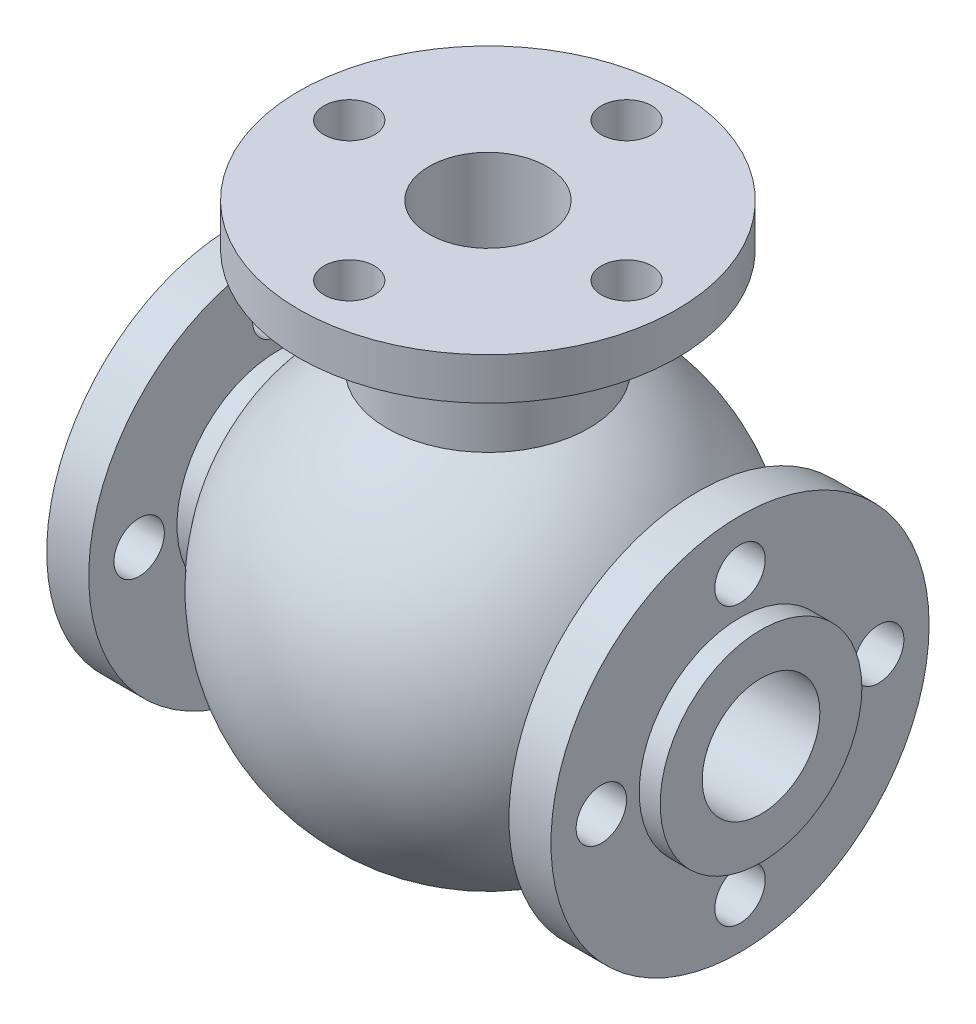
ISO-10303-21;
HEADER;
FILE_DESCRIPTION(('STEP AP214'),'2;1');
FILE_NAME('part.step','',(''),(''),'','','');
FILE_SCHEMA(('AUTOMOTIVE_DESIGN { 1 0 10303 214 1 1 1 1 }'));
ENDSEC;
DATA;
#1=APPLICATION_CONTEXT('core data for automotive mechanical design processes');
#2=APPLICATION_PROTOCOL_DEFINITION('international standard','automotive_design',2000,#1);
#3=PRODUCT_CONTEXT('',#1,'mechanical');
#4=PRODUCT('Part','Part','',(#3));
#5=PRODUCT_RELATED_PRODUCT_CATEGORY('part','',(#4));
#6=PRODUCT_DEFINITION_FORMATION('','',#4);
#7=PRODUCT_DEFINITION_CONTEXT('part definition',#1,'design');
#8=PRODUCT_DEFINITION('design','',#6,#7);
#9=PRODUCT_DEFINITION_SHAPE('','',#8);
#10=(LENGTH_UNIT() NAMED_UNIT(*) SI_UNIT(.MILLI.,.METRE.));
#11=(NAMED_UNIT(*) PLANE_ANGLE_UNIT() SI_UNIT($,.RADIAN.));
#12=(NAMED_UNIT(*) SI_UNIT($,.STERADIAN.) SOLID_ANGLE_UNIT());
#13=UNCERTAINTY_MEASURE_WITH_UNIT(LENGTH_MEASURE(1.E-05),#10,'distance_accuracy_value','');
#14=(GEOMETRIC_REPRESENTATION_CONTEXT(3) GLOBAL_UNCERTAINTY_ASSIGNED_CONTEXT((#13)) GLOBAL_UNIT_ASSIGNED_CONTEXT((#10,
#11,#12)) REPRESENTATION_CONTEXT('',''));
#15=CARTESIAN_POINT('',(0.,0.,0.));
#16=DIRECTION('',(0.,0.,1.));
#17=DIRECTION('',(1.,0.,0.));
#18=AXIS2_PLACEMENT_3D('',#15,#16,#17);
#19=CARTESIAN_POINT('',(0.,0.,0.));
#20=DIRECTION('',(1.,0.,0.));
#21=DIRECTION('',(0.,1.,0.));
#22=AXIS2_PLACEMENT_3D('',#19,#20,#21);
#23=SPHERICAL_SURFACE('',#22,41.);
#24=CARTESIAN_POINT('',(0.,38.5356977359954,0.));
#25=DIRECTION('',(0.,-1.,0.));
#26=DIRECTION('',(0.,0.,-1.));
#27=AXIS2_PLACEMENT_3D('',#24,#25,#26);
#28=CIRCLE('',#27,14.);
#29=CARTESIAN_POINT('',(0.,38.5356977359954,14.));
#30=VERTEX_POINT('',#29);
#31=EDGE_CURVE('E131',#30,#30,#28,.F.);
#32=ORIENTED_EDGE('',*,*,#31,.T.);
#33=EDGE_LOOP('',(#32));
#34=FACE_BOUND('',#33,.T.);
#35=CARTESIAN_POINT('',(38.5356977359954,0.,0.));
#36=DIRECTION('',(1.,0.,0.));
#37=DIRECTION('',(0.,0.,-1.));
#38=AXIS2_PLACEMENT_3D('',#35,#36,#37);
#39=CIRCLE('',#38,14.);
#40=CARTESIAN_POINT('',(38.5356977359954,0.,-14.));
#41=VERTEX_POINT('',#40);
#42=EDGE_CURVE('E111',#41,#41,#39,.T.);
#43=ORIENTED_EDGE('',*,*,#42,.T.);
#44=EDGE_LOOP('',(#43));
#45=FACE_BOUND('',#44,.T.);
#46=CARTESIAN_POINT('',(-38.5356977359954,0.,0.));
#47=DIRECTION('',(1.,0.,0.));
#48=DIRECTION('',(0.,0.,-1.));
#49=AXIS2_PLACEMENT_3D('',#46,#47,#48);
#50=CIRCLE('',#49,14.);
#51=CARTESIAN_POINT('',(-38.5356977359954,0.,-14.));
#52=VERTEX_POINT('',#51);
#53=EDGE_CURVE('E47',#52,#52,#50,.T.);
#54=ORIENTED_EDGE('',*,*,#53,.F.);
#55=EDGE_LOOP('',(#54));
#56=FACE_BOUND('',#55,.T.);
#57=ADVANCED_FACE('F40',(#34,#45,#56),#23,.F.);
#58=CARTESIAN_POINT('',(53.9110005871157,0.,0.));
#59=DIRECTION('',(1.,0.,0.));
#60=DIRECTION('',(0.,0.,-1.));
#61=AXIS2_PLACEMENT_3D('',#58,#59,#60);
#62=CYLINDRICAL_SURFACE('',#61,14.);
#63=ORIENTED_EDGE('',*,*,#53,.T.);
#64=EDGE_LOOP('',(#63));
#65=FACE_BOUND('',#64,.T.);
#66=CARTESIAN_POINT('',(-65.,0.,0.));
#67=DIRECTION('',(1.,0.,0.));
#68=DIRECTION('',(0.,0.,-1.));
#69=AXIS2_PLACEMENT_3D('',#66,#67,#68);
#70=CIRCLE('',#69,14.);
#71=CARTESIAN_POINT('',(-65.,0.,-14.));
#72=VERTEX_POINT('',#71);
#73=EDGE_CURVE('E52',#72,#72,#70,.T.);
#74=ORIENTED_EDGE('',*,*,#73,.F.);
#75=EDGE_LOOP('',(#74));
#76=FACE_BOUND('',#75,.T.);
#77=ADVANCED_FACE('F265',(#65,#76),#62,.F.);
#78=CARTESIAN_POINT('',(-65.,14.,0.));
#79=DIRECTION('',(-1.,0.,0.));
#80=DIRECTION('',(0.,0.,1.));
#81=AXIS2_PLACEMENT_3D('',#78,#79,#80);
#82=PLANE('',#81);
#83=ORIENTED_EDGE('',*,*,#73,.T.);
#84=EDGE_LOOP('',(#83));
#85=FACE_BOUND('',#84,.T.);
#86=CARTESIAN_POINT('',(-65.,0.,0.));
#87=DIRECTION('',(1.,0.,0.));
#88=DIRECTION('',(0.,0.,-1.));
#89=AXIS2_PLACEMENT_3D('',#86,#87,#88);
#90=CIRCLE('',#89,24.);
#91=CARTESIAN_POINT('',(-65.,0.,-24.));
#92=VERTEX_POINT('',#91);
#93=EDGE_CURVE('E57',#92,#92,#90,.T.);
#94=ORIENTED_EDGE('',*,*,#93,.F.);
#95=EDGE_LOOP('',(#94));
#96=FACE_BOUND('',#95,.T.);
#97=ADVANCED_FACE('F270',(#85,#96),#82,.T.);
#98=CARTESIAN_POINT('',(53.9110005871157,0.,0.));
#99=DIRECTION('',(1.,0.,0.));
#100=DIRECTION('',(0.,0.,-1.));
#101=AXIS2_PLACEMENT_3D('',#98,#99,#100);
#102=CYLINDRICAL_SURFACE('',#101,24.);
#103=ORIENTED_EDGE('',*,*,#93,.T.);
#104=EDGE_LOOP('',(#103));
#105=FACE_BOUND('',#104,.T.);
#106=CARTESIAN_POINT('',(-60.,0.,0.));
#107=DIRECTION('',(1.,0.,0.));
#108=DIRECTION('',(0.,0.,-1.));
#109=AXIS2_PLACEMENT_3D('',#106,#107,#108);
#110=CIRCLE('',#109,24.);
#111=CARTESIAN_POINT('',(-60.,0.,-24.));
#112=VERTEX_POINT('',#111);
#113=EDGE_CURVE('E63',#112,#112,#110,.T.);
#114=ORIENTED_EDGE('',*,*,#113,.F.);
#115=EDGE_LOOP('',(#114));
#116=FACE_BOUND('',#115,.T.);
#117=ADVANCED_FACE('F325',(#105,#116),#102,.T.);
#118=CARTESIAN_POINT('',(-60.,24.,0.));
#119=DIRECTION('',(-1.,0.,0.));
#120=DIRECTION('',(0.,0.,1.));
#121=AXIS2_PLACEMENT_3D('',#118,#119,#120);
#122=PLANE('',#121);
#123=CARTESIAN_POINT('',(-60.,33.,0.));
#124=DIRECTION('',(1.,0.,0.));
#125=DIRECTION('',(0.,0.,-1.));
#126=AXIS2_PLACEMENT_3D('',#123,#124,#125);
#127=CIRCLE('',#126,6.);
#128=CARTESIAN_POINT('',(-60.,33.,-6.));
#129=VERTEX_POINT('',#128);
#130=EDGE_CURVE('E149',#129,#129,#127,.T.);
#131=ORIENTED_EDGE('',*,*,#130,.T.);
#132=EDGE_LOOP('',(#131));
#133=FACE_BOUND('',#132,.T.);
#134=CARTESIAN_POINT('',(-60.,-1.15218884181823E-13,33.));
#135=DIRECTION('',(1.,0.,0.));
#136=DIRECTION('',(0.,1.,0.));
#137=AXIS2_PLACEMENT_3D('',#134,#135,#136);
#138=CIRCLE('',#137,6.);
#139=CARTESIAN_POINT('',(-60.,5.99999999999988,33.));
#140=VERTEX_POINT('',#139);
#141=EDGE_CURVE('E182',#140,#140,#138,.T.);
#142=ORIENTED_EDGE('',*,*,#141,.T.);
#143=EDGE_LOOP('',(#142));
#144=FACE_BOUND('',#143,.T.);
#145=CARTESIAN_POINT('',(-60.,-33.,0.));
#146=DIRECTION('',(1.,0.,0.));
#147=DIRECTION('',(0.,0.,1.));
#148=AXIS2_PLACEMENT_3D('',#145,#146,#147);
#149=CIRCLE('',#148,6.);
#150=CARTESIAN_POINT('',(-60.,-33.,6.));
#151=VERTEX_POINT('',#150);
#152=EDGE_CURVE('E172',#151,#151,#149,.T.);
#153=ORIENTED_EDGE('',*,*,#152,.T.);
#154=EDGE_LOOP('',(#153));
#155=FACE_BOUND('',#154,.T.);
#156=CARTESIAN_POINT('',(-60.,3.4565665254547E-13,-33.));
#157=DIRECTION('',(1.,0.,0.));
#158=DIRECTION('',(0.,-1.,0.));
#159=AXIS2_PLACEMENT_3D('',#156,#157,#158);
#160=CIRCLE('',#159,6.);
#161=CARTESIAN_POINT('',(-60.,-5.99999999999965,-33.0000000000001));
#162=VERTEX_POINT('',#161);
#163=EDGE_CURVE('E173',#162,#162,#160,.T.);
#164=ORIENTED_EDGE('',*,*,#163,.T.);
#165=EDGE_LOOP('',(#164));
#166=FACE_BOUND('',#165,.T.);
#167=ORIENTED_EDGE('',*,*,#113,.T.);
#168=EDGE_LOOP('',(#167));
#169=FACE_BOUND('',#168,.T.);
#170=CARTESIAN_POINT('',(-60.,0.,0.));
#171=DIRECTION('',(1.,0.,0.));
#172=DIRECTION('',(0.,0.,-1.));
#173=AXIS2_PLACEMENT_3D('',#170,#171,#172);
#174=CIRCLE('',#173,45.);
#175=CARTESIAN_POINT('',(-60.,0.,-45.));
#176=VERTEX_POINT('',#175);
#177=EDGE_CURVE('E67',#176,#176,#174,.T.);
#178=ORIENTED_EDGE('',*,*,#177,.F.);
#179=EDGE_LOOP('',(#178));
#180=FACE_BOUND('',#179,.T.);
#181=ADVANCED_FACE('F321',(#133,#144,#155,#166,#169,#180),#122,.T.);
#182=CARTESIAN_POINT('',(53.9110005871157,0.,0.));
#183=DIRECTION('',(1.,0.,0.));
#184=DIRECTION('',(0.,0.,-1.));
#185=AXIS2_PLACEMENT_3D('',#182,#183,#184);
#186=CYLINDRICAL_SURFACE('',#185,45.);
#187=ORIENTED_EDGE('',*,*,#177,.T.);
#188=EDGE_LOOP('',(#187));
#189=FACE_BOUND('',#188,.T.);
#190=CARTESIAN_POINT('',(-50.,0.,0.));
#191=DIRECTION('',(1.,0.,0.));
#192=DIRECTION('',(0.,0.,-1.));
#193=AXIS2_PLACEMENT_3D('',#190,#191,#192);
#194=CIRCLE('',#193,45.);
#195=CARTESIAN_POINT('',(-50.,0.,-45.));
#196=VERTEX_POINT('',#195);
#197=EDGE_CURVE('E71',#196,#196,#194,.T.);
#198=ORIENTED_EDGE('',*,*,#197,.F.);
#199=EDGE_LOOP('',(#198));
#200=FACE_BOUND('',#199,.T.);
#201=ADVANCED_FACE('F317',(#189,#200),#186,.T.);
#202=CARTESIAN_POINT('',(-50.,45.,0.));
#203=DIRECTION('',(1.,0.,0.));
#204=DIRECTION('',(0.,0.,-1.));
#205=AXIS2_PLACEMENT_3D('',#202,#203,#204);
#206=PLANE('',#205);
#207=CARTESIAN_POINT('',(-50.,33.,0.));
#208=DIRECTION('',(1.,0.,0.));
#209=DIRECTION('',(0.,0.,-1.));
#210=AXIS2_PLACEMENT_3D('',#207,#208,#209);
#211=CIRCLE('',#210,6.);
#212=CARTESIAN_POINT('',(-50.,33.,-6.));
#213=VERTEX_POINT('',#212);
#214=EDGE_CURVE('E190',#213,#213,#211,.T.);
#215=ORIENTED_EDGE('',*,*,#214,.F.);
#216=EDGE_LOOP('',(#215));
#217=FACE_BOUND('',#216,.T.);
#218=CARTESIAN_POINT('',(-50.,-1.15218884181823E-13,33.));
#219=DIRECTION('',(1.,0.,0.));
#220=DIRECTION('',(0.,0.,-1.));
#221=AXIS2_PLACEMENT_3D('',#218,#219,#220);
#222=CIRCLE('',#221,6.);
#223=CARTESIAN_POINT('',(-50.,-1.15218884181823E-13,27.));
#224=VERTEX_POINT('',#223);
#225=EDGE_CURVE('E186',#224,#224,#222,.T.);
#226=ORIENTED_EDGE('',*,*,#225,.F.);
#227=EDGE_LOOP('',(#226));
#228=FACE_BOUND('',#227,.T.);
#229=CARTESIAN_POINT('',(-50.,-33.,0.));
#230=DIRECTION('',(1.,0.,0.));
#231=DIRECTION('',(0.,0.,-1.));
#232=AXIS2_PLACEMENT_3D('',#229,#230,#231);
#233=CIRCLE('',#232,6.);
#234=CARTESIAN_POINT('',(-50.,-33.,-6.));
#235=VERTEX_POINT('',#234);
#236=EDGE_CURVE('E178',#235,#235,#233,.T.);
#237=ORIENTED_EDGE('',*,*,#236,.F.);
#238=EDGE_LOOP('',(#237));
#239=FACE_BOUND('',#238,.T.);
#240=CARTESIAN_POINT('',(-50.,3.4565665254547E-13,-33.));
#241=DIRECTION('',(1.,0.,0.));
#242=DIRECTION('',(0.,0.,-1.));
#243=AXIS2_PLACEMENT_3D('',#240,#241,#242);
#244=CIRCLE('',#243,6.);
#245=CARTESIAN_POINT('',(-50.,3.4565665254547E-13,-39.));
#246=VERTEX_POINT('',#245);
#247=EDGE_CURVE('E168',#246,#246,#244,.T.);
#248=ORIENTED_EDGE('',*,*,#247,.F.);
#249=EDGE_LOOP('',(#248));
#250=FACE_BOUND('',#249,.T.);
#251=ORIENTED_EDGE('',*,*,#197,.T.);
#252=EDGE_LOOP('',(#251));
#253=FACE_BOUND('',#252,.T.);
#254=CARTESIAN_POINT('',(-50.,0.,0.));
#255=DIRECTION('',(1.,0.,0.));
#256=DIRECTION('',(0.,0.,-1.));
#257=AXIS2_PLACEMENT_3D('',#254,#255,#256);
#258=CIRCLE('',#257,24.);
#259=CARTESIAN_POINT('',(-50.,0.,-24.));
#260=VERTEX_POINT('',#259);
#261=EDGE_CURVE('E75',#260,#260,#258,.T.);
#262=ORIENTED_EDGE('',*,*,#261,.F.);
#263=EDGE_LOOP('',(#262));
#264=FACE_BOUND('',#263,.T.);
#265=ADVANCED_FACE('F313',(#217,#228,#239,#250,#253,#264),#206,.T.);
#266=CARTESIAN_POINT('',(53.9110005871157,0.,0.));
#267=DIRECTION('',(1.,0.,0.));
#268=DIRECTION('',(0.,0.,-1.));
#269=AXIS2_PLACEMENT_3D('',#266,#267,#268);
#270=CYLINDRICAL_SURFACE('',#269,24.);
#271=ORIENTED_EDGE('',*,*,#261,.T.);
#272=EDGE_LOOP('',(#271));
#273=FACE_BOUND('',#272,.T.);
#274=CARTESIAN_POINT('',(-45.,0.,0.));
#275=DIRECTION('',(1.,0.,0.));
#276=DIRECTION('',(0.,0.,-1.));
#277=AXIS2_PLACEMENT_3D('',#274,#275,#276);
#278=CIRCLE('',#277,24.);
#279=CARTESIAN_POINT('',(-45.,0.,-24.));
#280=VERTEX_POINT('',#279);
#281=EDGE_CURVE('E79',#280,#280,#278,.T.);
#282=ORIENTED_EDGE('',*,*,#281,.F.);
#283=EDGE_LOOP('',(#282));
#284=FACE_BOUND('',#283,.T.);
#285=ADVANCED_FACE('F309',(#273,#284),#270,.T.);
#286=CARTESIAN_POINT('',(0.,0.,0.));
#287=DIRECTION('',(1.,0.,0.));
#288=DIRECTION('',(0.,1.,0.));
#289=AXIS2_PLACEMENT_3D('',#286,#287,#288);
#290=SPHERICAL_SURFACE('',#289,51.);
#291=CARTESIAN_POINT('',(0.,45.,0.));
#292=DIRECTION('',(0.,-1.,0.));
#293=DIRECTION('',(0.,0.,-1.));
#294=AXIS2_PLACEMENT_3D('',#291,#292,#293);
#295=CIRCLE('',#294,24.);
#296=CARTESIAN_POINT('',(0.,45.,-24.));
#297=VERTEX_POINT('',#296);
#298=EDGE_CURVE('E10',#297,#297,#295,.F.);
#299=ORIENTED_EDGE('',*,*,#298,.F.);
#300=EDGE_LOOP('',(#299));
#301=FACE_BOUND('',#300,.T.);
#302=ORIENTED_EDGE('',*,*,#281,.T.);
#303=EDGE_LOOP('',(#302));
#304=FACE_BOUND('',#303,.T.);
#305=CARTESIAN_POINT('',(45.,0.,0.));
#306=DIRECTION('',(1.,0.,0.));
#307=DIRECTION('',(0.,0.,-1.));
#308=AXIS2_PLACEMENT_3D('',#305,#306,#307);
#309=CIRCLE('',#308,24.);
#310=CARTESIAN_POINT('',(45.,0.,-24.));
#311=VERTEX_POINT('',#310);
#312=EDGE_CURVE('E83',#311,#311,#309,.T.);
#313=ORIENTED_EDGE('',*,*,#312,.F.);
#314=EDGE_LOOP('',(#313));
#315=FACE_BOUND('',#314,.T.);
#316=ADVANCED_FACE('F305',(#301,#304,#315),#290,.T.);
#317=CARTESIAN_POINT('',(53.9110005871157,0.,0.));
#318=DIRECTION('',(1.,0.,0.));
#319=DIRECTION('',(0.,0.,-1.));
#320=AXIS2_PLACEMENT_3D('',#317,#318,#319);
#321=CYLINDRICAL_SURFACE('',#320,24.);
#322=ORIENTED_EDGE('',*,*,#312,.T.);
#323=EDGE_LOOP('',(#322));
#324=FACE_BOUND('',#323,.T.);
#325=CARTESIAN_POINT('',(50.,0.,0.));
#326=DIRECTION('',(1.,0.,0.));
#327=DIRECTION('',(0.,0.,-1.));
#328=AXIS2_PLACEMENT_3D('',#325,#326,#327);
#329=CIRCLE('',#328,24.);
#330=CARTESIAN_POINT('',(50.,0.,-24.));
#331=VERTEX_POINT('',#330);
#332=EDGE_CURVE('E87',#331,#331,#329,.T.);
#333=ORIENTED_EDGE('',*,*,#332,.F.);
#334=EDGE_LOOP('',(#333));
#335=FACE_BOUND('',#334,.T.);
#336=ADVANCED_FACE('F301',(#324,#335),#321,.T.);
#337=CARTESIAN_POINT('',(50.,45.,0.));
#338=DIRECTION('',(-1.,0.,0.));
#339=DIRECTION('',(0.,0.,1.));
#340=AXIS2_PLACEMENT_3D('',#337,#338,#339);
#341=PLANE('',#340);
#342=CARTESIAN_POINT('',(50.,-1.15218884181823E-13,33.));
#343=DIRECTION('',(-1.,0.,0.));
#344=DIRECTION('',(0.,0.,1.));
#345=AXIS2_PLACEMENT_3D('',#342,#343,#344);
#346=CIRCLE('',#345,6.);
#347=CARTESIAN_POINT('',(50.,-1.15218884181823E-13,39.));
#348=VERTEX_POINT('',#347);
#349=EDGE_CURVE('E140',#348,#348,#346,.F.);
#350=ORIENTED_EDGE('',*,*,#349,.T.);
#351=EDGE_LOOP('',(#350));
#352=FACE_BOUND('',#351,.T.);
#353=CARTESIAN_POINT('',(50.,-33.,0.));
#354=DIRECTION('',(-1.,0.,0.));
#355=DIRECTION('',(0.,0.,1.));
#356=AXIS2_PLACEMENT_3D('',#353,#354,#355);
#357=CIRCLE('',#356,6.);
#358=CARTESIAN_POINT('',(50.,-33.,6.));
#359=VERTEX_POINT('',#358);
#360=EDGE_CURVE('E157',#359,#359,#357,.F.);
#361=ORIENTED_EDGE('',*,*,#360,.T.);
#362=EDGE_LOOP('',(#361));
#363=FACE_BOUND('',#362,.T.);
#364=CARTESIAN_POINT('',(50.,3.4565665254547E-13,-33.));
#365=DIRECTION('',(-1.,0.,0.));
#366=DIRECTION('',(0.,0.,1.));
#367=AXIS2_PLACEMENT_3D('',#364,#365,#366);
#368=CIRCLE('',#367,6.);
#369=CARTESIAN_POINT('',(50.,3.4565665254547E-13,-27.));
#370=VERTEX_POINT('',#369);
#371=EDGE_CURVE('E148',#370,#370,#368,.F.);
#372=ORIENTED_EDGE('',*,*,#371,.T.);
#373=EDGE_LOOP('',(#372));
#374=FACE_BOUND('',#373,.T.);
#375=CARTESIAN_POINT('',(50.,33.,0.));
#376=DIRECTION('',(-1.,0.,0.));
#377=DIRECTION('',(0.,0.,1.));
#378=AXIS2_PLACEMENT_3D('',#375,#376,#377);
#379=CIRCLE('',#378,6.);
#380=CARTESIAN_POINT('',(50.,33.,6.));
#381=VERTEX_POINT('',#380);
#382=EDGE_CURVE('E136',#381,#381,#379,.F.);
#383=ORIENTED_EDGE('',*,*,#382,.T.);
#384=EDGE_LOOP('',(#383));
#385=FACE_BOUND('',#384,.T.);
#386=ORIENTED_EDGE('',*,*,#332,.T.);
#387=EDGE_LOOP('',(#386));
#388=FACE_BOUND('',#387,.T.);
#389=CARTESIAN_POINT('',(50.,0.,0.));
#390=DIRECTION('',(1.,0.,0.));
#391=DIRECTION('',(0.,0.,-1.));
#392=AXIS2_PLACEMENT_3D('',#389,#390,#391);
#393=CIRCLE('',#392,45.);
#394=CARTESIAN_POINT('',(50.,0.,-45.));
#395=VERTEX_POINT('',#394);
#396=EDGE_CURVE('E91',#395,#395,#393,.T.);
#397=ORIENTED_EDGE('',*,*,#396,.F.);
#398=EDGE_LOOP('',(#397));
#399=FACE_BOUND('',#398,.T.);
#400=ADVANCED_FACE('F297',(#352,#363,#374,#385,#388,#399),#341,.T.);
#401=CARTESIAN_POINT('',(53.9110005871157,0.,0.));
#402=DIRECTION('',(1.,0.,0.));
#403=DIRECTION('',(0.,0.,-1.));
#404=AXIS2_PLACEMENT_3D('',#401,#402,#403);
#405=CYLINDRICAL_SURFACE('',#404,45.);
#406=ORIENTED_EDGE('',*,*,#396,.T.);
#407=EDGE_LOOP('',(#406));
#408=FACE_BOUND('',#407,.T.);
#409=CARTESIAN_POINT('',(60.,0.,0.));
#410=DIRECTION('',(1.,0.,0.));
#411=DIRECTION('',(0.,0.,-1.));
#412=AXIS2_PLACEMENT_3D('',#409,#410,#411);
#413=CIRCLE('',#412,45.);
#414=CARTESIAN_POINT('',(60.,0.,-45.));
#415=VERTEX_POINT('',#414);
#416=EDGE_CURVE('E95',#415,#415,#413,.T.);
#417=ORIENTED_EDGE('',*,*,#416,.F.);
#418=EDGE_LOOP('',(#417));
#419=FACE_BOUND('',#418,.T.);
#420=ADVANCED_FACE('F293',(#408,#419),#405,.T.);
#421=CARTESIAN_POINT('',(60.,24.,0.));
#422=DIRECTION('',(1.,0.,0.));
#423=DIRECTION('',(0.,0.,-1.));
#424=AXIS2_PLACEMENT_3D('',#421,#422,#423);
#425=PLANE('',#424);
#426=CARTESIAN_POINT('',(60.,-1.15218884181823E-13,33.));
#427=DIRECTION('',(1.,0.,0.));
#428=DIRECTION('',(0.,1.,0.));
#429=AXIS2_PLACEMENT_3D('',#426,#427,#428);
#430=CIRCLE('',#429,6.);
#431=CARTESIAN_POINT('',(60.,5.99999999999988,33.));
#432=VERTEX_POINT('',#431);
#433=EDGE_CURVE('E161',#432,#432,#430,.T.);
#434=ORIENTED_EDGE('',*,*,#433,.F.);
#435=EDGE_LOOP('',(#434));
#436=FACE_BOUND('',#435,.T.);
#437=CARTESIAN_POINT('',(60.,-33.,0.));
#438=DIRECTION('',(1.,0.,0.));
#439=DIRECTION('',(0.,0.,1.));
#440=AXIS2_PLACEMENT_3D('',#437,#438,#439);
#441=CIRCLE('',#440,6.);
#442=CARTESIAN_POINT('',(60.,-33.,6.));
#443=VERTEX_POINT('',#442);
#444=EDGE_CURVE('E153',#443,#443,#441,.T.);
#445=ORIENTED_EDGE('',*,*,#444,.F.);
#446=EDGE_LOOP('',(#445));
#447=FACE_BOUND('',#446,.T.);
#448=CARTESIAN_POINT('',(60.,3.4565665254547E-13,-33.));
#449=DIRECTION('',(1.,0.,0.));
#450=DIRECTION('',(0.,-1.,0.));
#451=AXIS2_PLACEMENT_3D('',#448,#449,#450);
#452=CIRCLE('',#451,6.);
#453=CARTESIAN_POINT('',(60.,-5.99999999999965,-33.0000000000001));
#454=VERTEX_POINT('',#453);
#455=EDGE_CURVE('E144',#454,#454,#452,.T.);
#456=ORIENTED_EDGE('',*,*,#455,.F.);
#457=EDGE_LOOP('',(#456));
#458=FACE_BOUND('',#457,.T.);
#459=CARTESIAN_POINT('',(60.,33.,0.));
#460=DIRECTION('',(1.,0.,0.));
#461=DIRECTION('',(0.,0.,-1.));
#462=AXIS2_PLACEMENT_3D('',#459,#460,#461);
#463=CIRCLE('',#462,6.);
#464=CARTESIAN_POINT('',(60.,33.,-6.));
#465=VERTEX_POINT('',#464);
#466=EDGE_CURVE('E135',#465,#465,#463,.T.);
#467=ORIENTED_EDGE('',*,*,#466,.F.);
#468=EDGE_LOOP('',(#467));
#469=FACE_BOUND('',#468,.T.);
#470=ORIENTED_EDGE('',*,*,#416,.T.);
#471=EDGE_LOOP('',(#470));
#472=FACE_BOUND('',#471,.T.);
#473=CARTESIAN_POINT('',(60.,0.,0.));
#474=DIRECTION('',(1.,0.,0.));
#475=DIRECTION('',(0.,0.,-1.));
#476=AXIS2_PLACEMENT_3D('',#473,#474,#475);
#477=CIRCLE('',#476,24.);
#478=CARTESIAN_POINT('',(60.,0.,-24.));
#479=VERTEX_POINT('',#478);
#480=EDGE_CURVE('E99',#479,#479,#477,.T.);
#481=ORIENTED_EDGE('',*,*,#480,.F.);
#482=EDGE_LOOP('',(#481));
#483=FACE_BOUND('',#482,.T.);
#484=ADVANCED_FACE('F289',(#436,#447,#458,#469,#472,#483),#425,.T.);
#485=CARTESIAN_POINT('',(53.9110005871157,0.,0.));
#486=DIRECTION('',(1.,0.,0.));
#487=DIRECTION('',(0.,0.,-1.));
#488=AXIS2_PLACEMENT_3D('',#485,#486,#487);
#489=CYLINDRICAL_SURFACE('',#488,24.);
#490=ORIENTED_EDGE('',*,*,#480,.T.);
#491=EDGE_LOOP('',(#490));
#492=FACE_BOUND('',#491,.T.);
#493=CARTESIAN_POINT('',(65.,0.,0.));
#494=DIRECTION('',(1.,0.,0.));
#495=DIRECTION('',(0.,0.,-1.));
#496=AXIS2_PLACEMENT_3D('',#493,#494,#495);
#497=CIRCLE('',#496,24.);
#498=CARTESIAN_POINT('',(65.,0.,-24.));
#499=VERTEX_POINT('',#498);
#500=EDGE_CURVE('E103',#499,#499,#497,.T.);
#501=ORIENTED_EDGE('',*,*,#500,.F.);
#502=EDGE_LOOP('',(#501));
#503=FACE_BOUND('',#502,.T.);
#504=ADVANCED_FACE('F283',(#492,#503),#489,.T.);
#505=CARTESIAN_POINT('',(65.,14.,0.));
#506=DIRECTION('',(1.,0.,0.));
#507=DIRECTION('',(0.,0.,-1.));
#508=AXIS2_PLACEMENT_3D('',#505,#506,#507);
#509=PLANE('',#508);
#510=ORIENTED_EDGE('',*,*,#500,.T.);
#511=EDGE_LOOP('',(#510));
#512=FACE_BOUND('',#511,.T.);
#513=CARTESIAN_POINT('',(65.,0.,0.));
#514=DIRECTION('',(1.,0.,0.));
#515=DIRECTION('',(0.,0.,-1.));
#516=AXIS2_PLACEMENT_3D('',#513,#514,#515);
#517=CIRCLE('',#516,14.);
#518=CARTESIAN_POINT('',(65.,0.,-14.));
#519=VERTEX_POINT('',#518);
#520=EDGE_CURVE('E107',#519,#519,#517,.T.);
#521=ORIENTED_EDGE('',*,*,#520,.F.);
#522=EDGE_LOOP('',(#521));
#523=FACE_BOUND('',#522,.T.);
#524=ADVANCED_FACE('F277',(#512,#523),#509,.T.);
#525=CARTESIAN_POINT('',(53.9110005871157,0.,0.));
#526=DIRECTION('',(1.,0.,0.));
#527=DIRECTION('',(0.,0.,-1.));
#528=AXIS2_PLACEMENT_3D('',#525,#526,#527);
#529=CYLINDRICAL_SURFACE('',#528,14.);
#530=ORIENTED_EDGE('',*,*,#520,.T.);
#531=EDGE_LOOP('',(#530));
#532=FACE_BOUND('',#531,.T.);
#533=ORIENTED_EDGE('',*,*,#42,.F.);
#534=EDGE_LOOP('',(#533));
#535=FACE_BOUND('',#534,.T.);
#536=ADVANCED_FACE('F261',(#532,#535),#529,.F.);
#537=CARTESIAN_POINT('',(0.,-51.002,0.));
#538=DIRECTION('',(0.,1.,0.));
#539=DIRECTION('',(0.,0.,1.));
#540=AXIS2_PLACEMENT_3D('',#537,#538,#539);
#541=CYLINDRICAL_SURFACE('',#540,24.);
#542=ORIENTED_EDGE('',*,*,#298,.T.);
#543=EDGE_LOOP('',(#542));
#544=FACE_BOUND('',#543,.T.);
#545=CARTESIAN_POINT('',(0.,70.,0.));
#546=DIRECTION('',(0.,1.,0.));
#547=DIRECTION('',(0.,0.,1.));
#548=AXIS2_PLACEMENT_3D('',#545,#546,#547);
#549=CIRCLE('',#548,24.);
#550=CARTESIAN_POINT('',(0.,70.,24.));
#551=VERTEX_POINT('',#550);
#552=EDGE_CURVE('E115',#551,#551,#549,.T.);
#553=ORIENTED_EDGE('',*,*,#552,.F.);
#554=EDGE_LOOP('',(#553));
#555=FACE_BOUND('',#554,.T.);
#556=ADVANCED_FACE('F252',(#544,#555),#541,.T.);
#557=CARTESIAN_POINT('',(0.,80.,0.));
#558=DIRECTION('',(0.,-1.,0.));
#559=DIRECTION('',(0.,0.,-1.));
#560=AXIS2_PLACEMENT_3D('',#557,#558,#559);
#561=CYLINDRICAL_SURFACE('',#560,45.);
#562=CARTESIAN_POINT('',(0.,80.,0.));
#563=DIRECTION('',(0.,1.,0.));
#564=DIRECTION('',(0.,0.,1.));
#565=AXIS2_PLACEMENT_3D('',#562,#563,#564);
#566=CIRCLE('',#565,45.);
#567=CARTESIAN_POINT('',(0.,80.,45.));
#568=VERTEX_POINT('',#567);
#569=EDGE_CURVE('E119',#568,#568,#566,.T.);
#570=ORIENTED_EDGE('',*,*,#569,.F.);
#571=EDGE_LOOP('',(#570));
#572=FACE_BOUND('',#571,.T.);
#573=CARTESIAN_POINT('',(0.,70.,0.));
#574=DIRECTION('',(0.,1.,0.));
#575=DIRECTION('',(0.,0.,1.));
#576=AXIS2_PLACEMENT_3D('',#573,#574,#575);
#577=CIRCLE('',#576,45.);
#578=CARTESIAN_POINT('',(0.,70.,45.));
#579=VERTEX_POINT('',#578);
#580=EDGE_CURVE('E120',#579,#579,#577,.T.);
#581=ORIENTED_EDGE('',*,*,#580,.T.);
#582=EDGE_LOOP('',(#581));
#583=FACE_BOUND('',#582,.T.);
#584=ADVANCED_FACE('F250',(#572,#583),#561,.T.);
#585=CARTESIAN_POINT('',(0.,80.,0.));
#586=DIRECTION('',(0.,1.,0.));
#587=DIRECTION('',(0.,0.,1.));
#588=AXIS2_PLACEMENT_3D('',#585,#586,#587);
#589=PLANE('',#588);
#590=CARTESIAN_POINT('',(-33.,80.,1.15218884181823E-13));
#591=DIRECTION('',(0.,1.,0.));
#592=DIRECTION('',(1.,0.,0.));
#593=AXIS2_PLACEMENT_3D('',#590,#591,#592);
#594=CIRCLE('',#593,6.);
#595=CARTESIAN_POINT('',(-33.,80.,6.00000000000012));
#596=VERTEX_POINT('',#595);
#597=EDGE_CURVE('E207',#596,#596,#594,.T.);
#598=ORIENTED_EDGE('',*,*,#597,.F.);
#599=EDGE_LOOP('',(#598));
#600=FACE_BOUND('',#599,.T.);
#601=CARTESIAN_POINT('',(0.,80.,33.));
#602=DIRECTION('',(0.,1.,0.));
#603=DIRECTION('',(0.,0.,-1.));
#604=AXIS2_PLACEMENT_3D('',#601,#602,#603);
#605=CIRCLE('',#604,6.);
#606=CARTESIAN_POINT('',(0.,80.,39.));
#607=VERTEX_POINT('',#606);
#608=EDGE_CURVE('E217',#607,#607,#605,.T.);
#609=ORIENTED_EDGE('',*,*,#608,.F.);
#610=EDGE_LOOP('',(#609));
#611=FACE_BOUND('',#610,.T.);
#612=CARTESIAN_POINT('',(33.,80.,-3.4565665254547E-13));
#613=DIRECTION('',(0.,1.,0.));
#614=DIRECTION('',(-1.,0.,0.));
#615=AXIS2_PLACEMENT_3D('',#612,#613,#614);
#616=CIRCLE('',#615,6.);
#617=CARTESIAN_POINT('',(33.,80.,5.99999999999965));
#618=VERTEX_POINT('',#617);
#619=EDGE_CURVE('E208',#618,#618,#616,.T.);
#620=ORIENTED_EDGE('',*,*,#619,.F.);
#621=EDGE_LOOP('',(#620));
#622=FACE_BOUND('',#621,.T.);
#623=CARTESIAN_POINT('',(0.,80.,-33.));
#624=DIRECTION('',(0.,1.,0.));
#625=DIRECTION('',(0.,0.,1.));
#626=AXIS2_PLACEMENT_3D('',#623,#624,#625);
#627=CIRCLE('',#626,6.);
#628=CARTESIAN_POINT('',(0.,80.,-27.));
#629=VERTEX_POINT('',#628);
#630=EDGE_CURVE('E177',#629,#629,#627,.T.);
#631=ORIENTED_EDGE('',*,*,#630,.F.);
#632=EDGE_LOOP('',(#631));
#633=FACE_BOUND('',#632,.T.);
#634=CARTESIAN_POINT('',(0.,80.,0.));
#635=DIRECTION('',(0.,1.,0.));
#636=DIRECTION('',(0.,0.,1.));
#637=AXIS2_PLACEMENT_3D('',#634,#635,#636);
#638=CIRCLE('',#637,14.);
#639=CARTESIAN_POINT('',(0.,80.,14.));
#640=VERTEX_POINT('',#639);
#641=EDGE_CURVE('E124',#640,#640,#638,.T.);
#642=ORIENTED_EDGE('',*,*,#641,.F.);
#643=EDGE_LOOP('',(#642));
#644=FACE_BOUND('',#643,.T.);
#645=ORIENTED_EDGE('',*,*,#569,.T.);
#646=EDGE_LOOP('',(#645));
#647=FACE_BOUND('',#646,.T.);
#648=ADVANCED_FACE('F238',(#600,#611,#622,#633,#644,#647),#589,.T.);
#649=CARTESIAN_POINT('',(0.,70.,0.));
#650=DIRECTION('',(0.,1.,0.));
#651=DIRECTION('',(0.,0.,1.));
#652=AXIS2_PLACEMENT_3D('',#649,#650,#651);
#653=PLANE('',#652);
#654=CARTESIAN_POINT('',(-33.,70.,1.15218884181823E-13));
#655=DIRECTION('',(0.,1.,0.));
#656=DIRECTION('',(0.,0.,1.));
#657=AXIS2_PLACEMENT_3D('',#654,#655,#656);
#658=CIRCLE('',#657,6.);
#659=CARTESIAN_POINT('',(-33.,70.,6.00000000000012));
#660=VERTEX_POINT('',#659);
#661=EDGE_CURVE('E221',#660,#660,#658,.F.);
#662=ORIENTED_EDGE('',*,*,#661,.F.);
#663=EDGE_LOOP('',(#662));
#664=FACE_BOUND('',#663,.T.);
#665=CARTESIAN_POINT('',(0.,70.,33.));
#666=DIRECTION('',(0.,1.,0.));
#667=DIRECTION('',(0.,0.,1.));
#668=AXIS2_PLACEMENT_3D('',#665,#666,#667);
#669=CIRCLE('',#668,6.);
#670=CARTESIAN_POINT('',(0.,70.,39.));
#671=VERTEX_POINT('',#670);
#672=EDGE_CURVE('E212',#671,#671,#669,.F.);
#673=ORIENTED_EDGE('',*,*,#672,.F.);
#674=EDGE_LOOP('',(#673));
#675=FACE_BOUND('',#674,.T.);
#676=CARTESIAN_POINT('',(33.,70.,-3.4565665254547E-13));
#677=DIRECTION('',(0.,1.,0.));
#678=DIRECTION('',(0.,0.,1.));
#679=AXIS2_PLACEMENT_3D('',#676,#677,#678);
#680=CIRCLE('',#679,6.);
#681=CARTESIAN_POINT('',(33.,70.,5.99999999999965));
#682=VERTEX_POINT('',#681);
#683=EDGE_CURVE('E213',#682,#682,#680,.F.);
#684=ORIENTED_EDGE('',*,*,#683,.F.);
#685=EDGE_LOOP('',(#684));
#686=FACE_BOUND('',#685,.T.);
#687=CARTESIAN_POINT('',(0.,70.,-33.));
#688=DIRECTION('',(0.,1.,0.));
#689=DIRECTION('',(0.,0.,1.));
#690=AXIS2_PLACEMENT_3D('',#687,#688,#689);
#691=CIRCLE('',#690,6.);
#692=CARTESIAN_POINT('',(0.,70.,-27.));
#693=VERTEX_POINT('',#692);
#694=EDGE_CURVE('E203',#693,#693,#691,.F.);
#695=ORIENTED_EDGE('',*,*,#694,.F.);
#696=EDGE_LOOP('',(#695));
#697=FACE_BOUND('',#696,.T.);
#698=ORIENTED_EDGE('',*,*,#552,.T.);
#699=EDGE_LOOP('',(#698));
#700=FACE_BOUND('',#699,.T.);
#701=ORIENTED_EDGE('',*,*,#580,.F.);
#702=EDGE_LOOP('',(#701));
#703=FACE_BOUND('',#702,.T.);
#704=ADVANCED_FACE('F234',(#664,#675,#686,#697,#700,#703),#653,.F.);
#705=CARTESIAN_POINT('',(0.,-51.001,0.));
#706=DIRECTION('',(0.,1.,0.));
#707=DIRECTION('',(0.,0.,1.));
#708=AXIS2_PLACEMENT_3D('',#705,#706,#707);
#709=CYLINDRICAL_SURFACE('',#708,14.);
#710=CARTESIAN_POINT('',(0.,38.5356977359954,14.));
#711=CARTESIAN_POINT('',(0.,38.9676175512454,14.));
#712=CARTESIAN_POINT('',(0.,39.3995373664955,14.));
#713=CARTESIAN_POINT('',(0.,40.2633769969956,14.));
#714=CARTESIAN_POINT('',(0.,40.6952968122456,14.));
#715=CARTESIAN_POINT('',(0.,41.5591364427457,14.));
#716=CARTESIAN_POINT('',(0.,41.9910562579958,14.));
#717=CARTESIAN_POINT('',(0.,42.8548958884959,14.));
#718=CARTESIAN_POINT('',(0.,43.2868157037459,14.));
#719=CARTESIAN_POINT('',(0.,44.150655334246,14.));
#720=CARTESIAN_POINT('',(0.,44.5825751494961,14.));
#721=CARTESIAN_POINT('',(0.,45.4464147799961,14.));
#722=CARTESIAN_POINT('',(0.,45.8783345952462,14.));
#723=CARTESIAN_POINT('',(0.,46.7421742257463,14.));
#724=CARTESIAN_POINT('',(0.,47.1740940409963,14.));
#725=CARTESIAN_POINT('',(0.,48.0379336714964,14.));
#726=CARTESIAN_POINT('',(0.,48.4698534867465,14.));
#727=CARTESIAN_POINT('',(0.,49.3336931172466,14.));
#728=CARTESIAN_POINT('',(0.,49.7656129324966,14.));
#729=CARTESIAN_POINT('',(0.,50.6294525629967,14.));
#730=CARTESIAN_POINT('',(0.,51.0613723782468,14.));
#731=CARTESIAN_POINT('',(0.,51.9252120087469,14.));
#732=CARTESIAN_POINT('',(0.,52.3571318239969,14.));
#733=CARTESIAN_POINT('',(0.,53.220971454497,14.));
#734=CARTESIAN_POINT('',(0.,53.6528912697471,14.));
#735=CARTESIAN_POINT('',(0.,54.5167309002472,14.));
#736=CARTESIAN_POINT('',(0.,54.9486507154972,14.));
#737=CARTESIAN_POINT('',(0.,55.8124903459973,14.));
#738=CARTESIAN_POINT('',(0.,56.2444101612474,14.));
#739=CARTESIAN_POINT('',(0.,57.1082497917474,14.));
#740=CARTESIAN_POINT('',(0.,57.5401696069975,14.));
#741=CARTESIAN_POINT('',(0.,58.4040092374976,14.));
#742=CARTESIAN_POINT('',(0.,58.8359290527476,14.));
#743=CARTESIAN_POINT('',(0.,59.6997686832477,14.));
#744=CARTESIAN_POINT('',(0.,60.1316884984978,14.));
#745=CARTESIAN_POINT('',(0.,60.9955281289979,14.));
#746=CARTESIAN_POINT('',(0.,61.4274479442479,14.));
#747=CARTESIAN_POINT('',(0.,62.291287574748,14.));
#748=CARTESIAN_POINT('',(0.,62.7232073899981,14.));
#749=CARTESIAN_POINT('',(0.,63.5870470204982,14.));
#750=CARTESIAN_POINT('',(0.,64.0189668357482,14.));
#751=CARTESIAN_POINT('',(0.,64.8828064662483,14.));
#752=CARTESIAN_POINT('',(0.,65.3147262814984,14.));
#753=CARTESIAN_POINT('',(0.,66.1785659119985,14.));
#754=CARTESIAN_POINT('',(0.,66.6104857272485,14.));
#755=CARTESIAN_POINT('',(0.,67.4743253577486,14.));
#756=CARTESIAN_POINT('',(0.,67.9062451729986,14.));
#757=CARTESIAN_POINT('',(0.,68.7700848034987,14.));
#758=CARTESIAN_POINT('',(0.,69.2020046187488,14.));
#759=CARTESIAN_POINT('',(0.,70.0658442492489,14.));
#760=CARTESIAN_POINT('',(0.,70.4977640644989,14.));
#761=CARTESIAN_POINT('',(0.,71.361603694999,14.));
#762=CARTESIAN_POINT('',(0.,71.7935235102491,14.));
#763=CARTESIAN_POINT('',(0.,72.6573631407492,14.));
#764=CARTESIAN_POINT('',(0.,73.0892829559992,14.));
#765=CARTESIAN_POINT('',(0.,73.9531225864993,14.));
#766=CARTESIAN_POINT('',(0.,74.3850424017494,14.));
#767=CARTESIAN_POINT('',(0.,75.2488820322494,14.));
#768=CARTESIAN_POINT('',(0.,75.6808018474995,14.));
#769=CARTESIAN_POINT('',(0.,76.5446414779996,14.));
#770=CARTESIAN_POINT('',(0.,76.9765612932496,14.));
#771=CARTESIAN_POINT('',(0.,77.8404009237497,14.));
#772=CARTESIAN_POINT('',(0.,78.2723207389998,14.));
#773=CARTESIAN_POINT('',(0.,79.1361603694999,14.));
#774=CARTESIAN_POINT('',(0.,79.5680801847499,14.));
#775=CARTESIAN_POINT('',(0.,80.,14.));
#776=B_SPLINE_CURVE_WITH_KNOTS('',3,(#710,#711,#712,#713,#714,#715,#716,#717,#718,#719,#720,
#721,#722,#723,#724,#725,#726,#727,#728,#729,#730,#731,#732,#733,#734,#735,#736,#737,#738,#739,
#740,#741,#742,#743,#744,#745,#746,#747,#748,#749,#750,#751,#752,#753,#754,#755,#756,#757,#758,
#759,#760,#761,#762,#763,#764,#765,#766,#767,#768,#769,#770,#771,#772,#773,#774,#775),
.UNSPECIFIED.,.F.,.F.,(4,2,2,2,2,2,2,2,2,2,2,2,2,2,2,2,2,2,2,2,2,2,2,2,2,2,2,2,2,2,2,2,4),(0.,
1.29575944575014,2.59151889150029,3.88727833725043,5.18303778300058,6.47879722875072,
7.77455667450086,9.07031612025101,10.3660755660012,11.6618350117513,12.9575944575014,
14.2533539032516,15.5491133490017,16.8448727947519,18.140632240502,19.4363916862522,
20.7321511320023,22.0279105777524,23.3236700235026,24.6194294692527,25.9151889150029,
27.210948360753,28.5067078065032,29.8024672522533,31.0982266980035,32.3939861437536,
33.6897455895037,34.9855050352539,36.281264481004,37.5770239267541,38.8727833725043,
40.1685428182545,41.4643022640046),.UNSPECIFIED.);
#777=EDGE_CURVE('BSEAM237',#30,#640,#776,.T.);
#778=ORIENTED_EDGE('',*,*,#31,.F.);
#779=ORIENTED_EDGE('',*,*,#641,.T.);
#780=ORIENTED_EDGE('',*,*,#777,.T.);
#781=ORIENTED_EDGE('',*,*,#777,.F.);
#782=EDGE_LOOP('',(#778,#780,#779,#781));
#783=FACE_BOUND('',#782,.T.);
#784=ADVANCED_FACE('F237',(#783),#709,.F.);
#785=CARTESIAN_POINT('',(-65.001,33.,0.));
#786=DIRECTION('',(1.,0.,0.));
#787=DIRECTION('',(0.,0.,-1.));
#788=AXIS2_PLACEMENT_3D('',#785,#786,#787);
#789=CYLINDRICAL_SURFACE('',#788,6.);
#790=ORIENTED_EDGE('',*,*,#382,.F.);
#791=EDGE_LOOP('',(#790));
#792=FACE_BOUND('',#791,.T.);
#793=ORIENTED_EDGE('',*,*,#466,.T.);
#794=EDGE_LOOP('',(#793));
#795=FACE_BOUND('',#794,.T.);
#796=ADVANCED_FACE('F456',(#792,#795),#789,.F.);
#797=CARTESIAN_POINT('',(-65.001,3.4565665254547E-13,-33.));
#798=DIRECTION('',(1.,0.,0.));
#799=DIRECTION('',(0.,0.,-1.));
#800=AXIS2_PLACEMENT_3D('',#797,#798,#799);
#801=CYLINDRICAL_SURFACE('',#800,6.);
#802=ORIENTED_EDGE('',*,*,#371,.F.);
#803=EDGE_LOOP('',(#802));
#804=FACE_BOUND('',#803,.T.);
#805=ORIENTED_EDGE('',*,*,#455,.T.);
#806=EDGE_LOOP('',(#805));
#807=FACE_BOUND('',#806,.T.);
#808=ADVANCED_FACE('F464',(#804,#807),#801,.F.);
#809=CARTESIAN_POINT('',(-65.001,-33.,0.));
#810=DIRECTION('',(1.,0.,0.));
#811=DIRECTION('',(0.,0.,-1.));
#812=AXIS2_PLACEMENT_3D('',#809,#810,#811);
#813=CYLINDRICAL_SURFACE('',#812,6.);
#814=ORIENTED_EDGE('',*,*,#360,.F.);
#815=EDGE_LOOP('',(#814));
#816=FACE_BOUND('',#815,.T.);
#817=ORIENTED_EDGE('',*,*,#444,.T.);
#818=EDGE_LOOP('',(#817));
#819=FACE_BOUND('',#818,.T.);
#820=ADVANCED_FACE('F472',(#816,#819),#813,.F.);
#821=CARTESIAN_POINT('',(-65.001,-1.15218884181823E-13,33.));
#822=DIRECTION('',(1.,0.,0.));
#823=DIRECTION('',(0.,0.,-1.));
#824=AXIS2_PLACEMENT_3D('',#821,#822,#823);
#825=CYLINDRICAL_SURFACE('',#824,6.);
#826=ORIENTED_EDGE('',*,*,#349,.F.);
#827=EDGE_LOOP('',(#826));
#828=FACE_BOUND('',#827,.T.);
#829=ORIENTED_EDGE('',*,*,#433,.T.);
#830=EDGE_LOOP('',(#829));
#831=FACE_BOUND('',#830,.T.);
#832=ADVANCED_FACE('F481',(#828,#831),#825,.F.);
#833=CARTESIAN_POINT('',(65.001,3.4565665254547E-13,-33.));
#834=DIRECTION('',(-1.,0.,0.));
#835=DIRECTION('',(0.,0.,1.));
#836=AXIS2_PLACEMENT_3D('',#833,#834,#835);
#837=CYLINDRICAL_SURFACE('',#836,6.);
#838=ORIENTED_EDGE('',*,*,#247,.T.);
#839=EDGE_LOOP('',(#838));
#840=FACE_BOUND('',#839,.T.);
#841=ORIENTED_EDGE('',*,*,#163,.F.);
#842=EDGE_LOOP('',(#841));
#843=FACE_BOUND('',#842,.T.);
#844=ADVANCED_FACE('F489',(#840,#843),#837,.F.);
#845=CARTESIAN_POINT('',(65.001,-33.,0.));
#846=DIRECTION('',(-1.,0.,0.));
#847=DIRECTION('',(0.,0.,1.));
#848=AXIS2_PLACEMENT_3D('',#845,#846,#847);
#849=CYLINDRICAL_SURFACE('',#848,6.);
#850=ORIENTED_EDGE('',*,*,#236,.T.);
#851=EDGE_LOOP('',(#850));
#852=FACE_BOUND('',#851,.T.);
#853=ORIENTED_EDGE('',*,*,#152,.F.);
#854=EDGE_LOOP('',(#853));
#855=FACE_BOUND('',#854,.T.);
#856=ADVANCED_FACE('F497',(#852,#855),#849,.F.);
#857=CARTESIAN_POINT('',(65.001,-1.15218884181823E-13,33.));
#858=DIRECTION('',(-1.,0.,0.));
#859=DIRECTION('',(0.,0.,1.));
#860=AXIS2_PLACEMENT_3D('',#857,#858,#859);
#861=CYLINDRICAL_SURFACE('',#860,6.);
#862=ORIENTED_EDGE('',*,*,#225,.T.);
#863=EDGE_LOOP('',(#862));
#864=FACE_BOUND('',#863,.T.);
#865=ORIENTED_EDGE('',*,*,#141,.F.);
#866=EDGE_LOOP('',(#865));
#867=FACE_BOUND('',#866,.T.);
#868=ADVANCED_FACE('F506',(#864,#867),#861,.F.);
#869=CARTESIAN_POINT('',(65.001,33.,0.));
#870=DIRECTION('',(-1.,0.,0.));
#871=DIRECTION('',(0.,0.,1.));
#872=AXIS2_PLACEMENT_3D('',#869,#870,#871);
#873=CYLINDRICAL_SURFACE('',#872,6.);
#874=ORIENTED_EDGE('',*,*,#214,.T.);
#875=EDGE_LOOP('',(#874));
#876=FACE_BOUND('',#875,.T.);
#877=ORIENTED_EDGE('',*,*,#130,.F.);
#878=EDGE_LOOP('',(#877));
#879=FACE_BOUND('',#878,.T.);
#880=ADVANCED_FACE('F515',(#876,#879),#873,.F.);
#881=CARTESIAN_POINT('',(0.,-51.001,-33.));
#882=DIRECTION('',(0.,1.,0.));
#883=DIRECTION('',(0.,0.,1.));
#884=AXIS2_PLACEMENT_3D('',#881,#882,#883);
#885=CYLINDRICAL_SURFACE('',#884,6.);
#886=CARTESIAN_POINT('',(0.,80.,-27.));
#887=CARTESIAN_POINT('',(0.,79.8958333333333,-27.));
#888=CARTESIAN_POINT('',(0.,79.7916666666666,-27.));
#889=CARTESIAN_POINT('',(0.,79.5833333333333,-27.));
#890=CARTESIAN_POINT('',(0.,79.4791666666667,-27.));
#891=CARTESIAN_POINT('',(0.,79.2708333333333,-27.));
#892=CARTESIAN_POINT('',(0.,79.1666666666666,-27.));
#893=CARTESIAN_POINT('',(0.,78.9583333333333,-27.));
#894=CARTESIAN_POINT('',(0.,78.8541666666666,-27.));
#895=CARTESIAN_POINT('',(0.,78.6458333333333,-27.));
#896=CARTESIAN_POINT('',(0.,78.5416666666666,-27.));
#897=CARTESIAN_POINT('',(0.,78.3333333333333,-27.));
#898=CARTESIAN_POINT('',(0.,78.2291666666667,-27.));
#899=CARTESIAN_POINT('',(0.,78.0208333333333,-27.));
#900=CARTESIAN_POINT('',(0.,77.9166666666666,-27.));
#901=CARTESIAN_POINT('',(0.,77.7083333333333,-27.));
#902=CARTESIAN_POINT('',(0.,77.6041666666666,-27.));
#903=CARTESIAN_POINT('',(0.,77.3958333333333,-27.));
#904=CARTESIAN_POINT('',(0.,77.2916666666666,-27.));
#905=CARTESIAN_POINT('',(0.,77.0833333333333,-27.));
#906=CARTESIAN_POINT('',(0.,76.9791666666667,-27.));
#907=CARTESIAN_POINT('',(0.,76.7708333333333,-27.));
#908=CARTESIAN_POINT('',(0.,76.6666666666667,-27.));
#909=CARTESIAN_POINT('',(0.,76.4583333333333,-27.));
#910=CARTESIAN_POINT('',(0.,76.3541666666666,-27.));
#911=CARTESIAN_POINT('',(0.,76.1458333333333,-27.));
#912=CARTESIAN_POINT('',(0.,76.0416666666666,-27.));
#913=CARTESIAN_POINT('',(0.,75.8333333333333,-27.));
#914=CARTESIAN_POINT('',(0.,75.7291666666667,-27.));
#915=CARTESIAN_POINT('',(0.,75.5208333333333,-27.));
#916=CARTESIAN_POINT('',(0.,75.4166666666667,-27.));
#917=CARTESIAN_POINT('',(0.,75.2083333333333,-27.));
#918=CARTESIAN_POINT('',(0.,75.1041666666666,-27.));
#919=CARTESIAN_POINT('',(0.,74.8958333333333,-27.));
#920=CARTESIAN_POINT('',(0.,74.7916666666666,-27.));
#921=CARTESIAN_POINT('',(0.,74.5833333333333,-27.));
#922=CARTESIAN_POINT('',(0.,74.4791666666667,-27.));
#923=CARTESIAN_POINT('',(0.,74.2708333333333,-27.));
#924=CARTESIAN_POINT('',(0.,74.1666666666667,-27.));
#925=CARTESIAN_POINT('',(0.,73.9583333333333,-27.));
#926=CARTESIAN_POINT('',(0.,73.8541666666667,-27.));
#927=CARTESIAN_POINT('',(0.,73.6458333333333,-27.));
#928=CARTESIAN_POINT('',(0.,73.5416666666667,-27.));
#929=CARTESIAN_POINT('',(0.,73.3333333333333,-27.));
#930=CARTESIAN_POINT('',(0.,73.2291666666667,-27.));
#931=CARTESIAN_POINT('',(0.,73.0208333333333,-27.));
#932=CARTESIAN_POINT('',(0.,72.9166666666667,-27.));
#933=CARTESIAN_POINT('',(0.,72.7083333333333,-27.));
#934=CARTESIAN_POINT('',(0.,72.6041666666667,-27.));
#935=CARTESIAN_POINT('',(0.,72.3958333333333,-27.));
#936=CARTESIAN_POINT('',(0.,72.2916666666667,-27.));
#937=CARTESIAN_POINT('',(0.,72.0833333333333,-27.));
#938=CARTESIAN_POINT('',(0.,71.9791666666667,-27.));
#939=CARTESIAN_POINT('',(0.,71.7708333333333,-27.));
#940=CARTESIAN_POINT('',(0.,71.6666666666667,-27.));
#941=CARTESIAN_POINT('',(0.,71.4583333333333,-27.));
#942=CARTESIAN_POINT('',(0.,71.3541666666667,-27.));
#943=CARTESIAN_POINT('',(0.,71.1458333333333,-27.));
#944=CARTESIAN_POINT('',(0.,71.0416666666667,-27.));
#945=CARTESIAN_POINT('',(0.,70.8333333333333,-27.));
#946=CARTESIAN_POINT('',(0.,70.7291666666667,-27.));
#947=CARTESIAN_POINT('',(0.,70.5208333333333,-27.));
#948=CARTESIAN_POINT('',(0.,70.4166666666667,-27.));
#949=CARTESIAN_POINT('',(0.,70.2083333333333,-27.));
#950=CARTESIAN_POINT('',(0.,70.1041666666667,-27.));
#951=CARTESIAN_POINT('',(0.,70.,-27.));
#952=B_SPLINE_CURVE_WITH_KNOTS('',3,(#886,#887,#888,#889,#890,#891,#892,#893,#894,#895,#896,
#897,#898,#899,#900,#901,#902,#903,#904,#905,#906,#907,#908,#909,#910,#911,#912,#913,#914,#915,
#916,#917,#918,#919,#920,#921,#922,#923,#924,#925,#926,#927,#928,#929,#930,#931,#932,#933,#934,
#935,#936,#937,#938,#939,#940,#941,#942,#943,#944,#945,#946,#947,#948,#949,#950,#951),
.UNSPECIFIED.,.F.,.F.,(4,2,2,2,2,2,2,2,2,2,2,2,2,2,2,2,2,2,2,2,2,2,2,2,2,2,2,2,2,2,2,2,4),(0.,
0.312499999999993,0.624999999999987,0.937500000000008,1.25,1.56249999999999,1.87499999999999,
2.18750000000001,2.5,2.8125,3.12499999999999,3.43749999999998,3.75,4.0625,4.37499999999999,
4.68749999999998,5.,5.3125,5.62499999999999,5.93749999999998,6.24999999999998,6.56249999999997,
6.87499999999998,7.18749999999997,7.49999999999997,7.81249999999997,8.12499999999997,
8.43749999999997,8.74999999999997,9.06249999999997,9.37499999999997,9.68749999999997,
9.99999999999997),.UNSPECIFIED.);
#953=EDGE_CURVE('BSEAM524',#629,#693,#952,.T.);
#954=ORIENTED_EDGE('',*,*,#630,.T.);
#955=ORIENTED_EDGE('',*,*,#694,.T.);
#956=ORIENTED_EDGE('',*,*,#953,.T.);
#957=ORIENTED_EDGE('',*,*,#953,.F.);
#958=EDGE_LOOP('',(#954,#956,#955,#957));
#959=FACE_BOUND('',#958,.T.);
#960=ADVANCED_FACE('F524',(#959),#885,.F.);
#961=CARTESIAN_POINT('',(33.,-51.001,-3.4565665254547E-13));
#962=DIRECTION('',(0.,1.,0.));
#963=DIRECTION('',(0.,0.,1.));
#964=AXIS2_PLACEMENT_3D('',#961,#962,#963);
#965=CYLINDRICAL_SURFACE('',#964,6.);
#966=CARTESIAN_POINT('',(33.,80.,5.99999999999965));
#967=CARTESIAN_POINT('',(33.,79.8958333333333,5.99999999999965));
#968=CARTESIAN_POINT('',(33.,79.7916666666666,5.99999999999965));
#969=CARTESIAN_POINT('',(33.,79.5833333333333,5.99999999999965));
#970=CARTESIAN_POINT('',(33.,79.4791666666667,5.99999999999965));
#971=CARTESIAN_POINT('',(33.,79.2708333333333,5.99999999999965));
#972=CARTESIAN_POINT('',(33.,79.1666666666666,5.99999999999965));
#973=CARTESIAN_POINT('',(33.,78.9583333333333,5.99999999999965));
#974=CARTESIAN_POINT('',(33.,78.8541666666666,5.99999999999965));
#975=CARTESIAN_POINT('',(33.,78.6458333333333,5.99999999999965));
#976=CARTESIAN_POINT('',(33.,78.5416666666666,5.99999999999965));
#977=CARTESIAN_POINT('',(33.,78.3333333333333,5.99999999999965));
#978=CARTESIAN_POINT('',(33.,78.2291666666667,5.99999999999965));
#979=CARTESIAN_POINT('',(33.,78.0208333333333,5.99999999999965));
#980=CARTESIAN_POINT('',(33.,77.9166666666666,5.99999999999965));
#981=CARTESIAN_POINT('',(33.,77.7083333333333,5.99999999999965));
#982=CARTESIAN_POINT('',(33.,77.6041666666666,5.99999999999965));
#983=CARTESIAN_POINT('',(33.,77.3958333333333,5.99999999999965));
#984=CARTESIAN_POINT('',(33.,77.2916666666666,5.99999999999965));
#985=CARTESIAN_POINT('',(33.,77.0833333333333,5.99999999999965));
#986=CARTESIAN_POINT('',(33.,76.9791666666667,5.99999999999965));
#987=CARTESIAN_POINT('',(33.,76.7708333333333,5.99999999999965));
#988=CARTESIAN_POINT('',(33.,76.6666666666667,5.99999999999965));
#989=CARTESIAN_POINT('',(33.,76.4583333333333,5.99999999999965));
#990=CARTESIAN_POINT('',(33.,76.3541666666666,5.99999999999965));
#991=CARTESIAN_POINT('',(33.,76.1458333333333,5.99999999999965));
#992=CARTESIAN_POINT('',(33.,76.0416666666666,5.99999999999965));
#993=CARTESIAN_POINT('',(33.,75.8333333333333,5.99999999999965));
#994=CARTESIAN_POINT('',(33.,75.7291666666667,5.99999999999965));
#995=CARTESIAN_POINT('',(33.,75.5208333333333,5.99999999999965));
#996=CARTESIAN_POINT('',(33.,75.4166666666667,5.99999999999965));
#997=CARTESIAN_POINT('',(33.,75.2083333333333,5.99999999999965));
#998=CARTESIAN_POINT('',(33.,75.1041666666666,5.99999999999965));
#999=CARTESIAN_POINT('',(33.,74.8958333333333,5.99999999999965));
#1000=CARTESIAN_POINT('',(33.,74.7916666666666,5.99999999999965));
#1001=CARTESIAN_POINT('',(33.,74.5833333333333,5.99999999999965));
#1002=CARTESIAN_POINT('',(33.,74.4791666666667,5.99999999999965));
#1003=CARTESIAN_POINT('',(33.,74.2708333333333,5.99999999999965));
#1004=CARTESIAN_POINT('',(33.,74.1666666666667,5.99999999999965));
#1005=CARTESIAN_POINT('',(33.,73.9583333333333,5.99999999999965));
#1006=CARTESIAN_POINT('',(33.,73.8541666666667,5.99999999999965));
#1007=CARTESIAN_POINT('',(33.,73.6458333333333,5.99999999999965));
#1008=CARTESIAN_POINT('',(33.,73.5416666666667,5.99999999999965));
#1009=CARTESIAN_POINT('',(33.,73.3333333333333,5.99999999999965));
#1010=CARTESIAN_POINT('',(33.,73.2291666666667,5.99999999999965));
#1011=CARTESIAN_POINT('',(33.,73.0208333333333,5.99999999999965));
#1012=CARTESIAN_POINT('',(33.,72.9166666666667,5.99999999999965));
#1013=CARTESIAN_POINT('',(33.,72.7083333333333,5.99999999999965));
#1014=CARTESIAN_POINT('',(33.,72.6041666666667,5.99999999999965));
#1015=CARTESIAN_POINT('',(33.,72.3958333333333,5.99999999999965));
#1016=CARTESIAN_POINT('',(33.,72.2916666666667,5.99999999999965));
#1017=CARTESIAN_POINT('',(33.,72.0833333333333,5.99999999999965));
#1018=CARTESIAN_POINT('',(33.,71.9791666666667,5.99999999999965));
#1019=CARTESIAN_POINT('',(33.,71.7708333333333,5.99999999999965));
#1020=CARTESIAN_POINT('',(33.,71.6666666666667,5.99999999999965));
#1021=CARTESIAN_POINT('',(33.,71.4583333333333,5.99999999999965));
#1022=CARTESIAN_POINT('',(33.,71.3541666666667,5.99999999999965));
#1023=CARTESIAN_POINT('',(33.,71.1458333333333,5.99999999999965));
#1024=CARTESIAN_POINT('',(33.,71.0416666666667,5.99999999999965));
#1025=CARTESIAN_POINT('',(33.,70.8333333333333,5.99999999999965));
#1026=CARTESIAN_POINT('',(33.,70.7291666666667,5.99999999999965));
#1027=CARTESIAN_POINT('',(33.,70.5208333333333,5.99999999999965));
#1028=CARTESIAN_POINT('',(33.,70.4166666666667,5.99999999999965));
#1029=CARTESIAN_POINT('',(33.,70.2083333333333,5.99999999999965));
#1030=CARTESIAN_POINT('',(33.,70.1041666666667,5.99999999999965));
#1031=CARTESIAN_POINT('',(33.,70.,5.99999999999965));
#1032=B_SPLINE_CURVE_WITH_KNOTS('',3,(#966,#967,#968,#969,#970,#971,#972,#973,#974,#975,#976,
#977,#978,#979,#980,#981,#982,#983,#984,#985,#986,#987,#988,#989,#990,#991,#992,#993,#994,#995,
#996,#997,#998,#999,#1000,#1001,#1002,#1003,#1004,#1005,#1006,#1007,#1008,#1009,#1010,#1011,
#1012,#1013,#1014,#1015,#1016,#1017,#1018,#1019,#1020,#1021,#1022,#1023,#1024,#1025,#1026,#1027,
#1028,#1029,#1030,#1031),.UNSPECIFIED.,.F.,.F.,(4,2,2,2,2,2,2,2,2,2,2,2,2,2,2,2,2,2,2,2,2,2,2,2,
2,2,2,2,2,2,2,2,4),(0.,0.312499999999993,0.624999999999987,0.937500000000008,1.25,
1.56249999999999,1.87499999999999,2.18750000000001,2.5,2.8125,3.12499999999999,3.43749999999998,
3.75,4.0625,4.37499999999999,4.68749999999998,5.,5.3125,5.62499999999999,5.93749999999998,
6.24999999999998,6.56249999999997,6.87499999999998,7.18749999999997,7.49999999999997,
7.81249999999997,8.12499999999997,8.43749999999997,8.74999999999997,9.06249999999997,
9.37499999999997,9.68749999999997,9.99999999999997),.UNSPECIFIED.);
#1033=EDGE_CURVE('BSEAM532',#618,#682,#1032,.T.);
#1034=ORIENTED_EDGE('',*,*,#619,.T.);
#1035=ORIENTED_EDGE('',*,*,#683,.T.);
#1036=ORIENTED_EDGE('',*,*,#1033,.T.);
#1037=ORIENTED_EDGE('',*,*,#1033,.F.);
#1038=EDGE_LOOP('',(#1034,#1036,#1035,#1037));
#1039=FACE_BOUND('',#1038,.T.);
#1040=ADVANCED_FACE('F532',(#1039),#965,.F.);
#1041=CARTESIAN_POINT('',(0.,-51.001,33.));
#1042=DIRECTION('',(0.,1.,0.));
#1043=DIRECTION('',(0.,0.,1.));
#1044=AXIS2_PLACEMENT_3D('',#1041,#1042,#1043);
#1045=CYLINDRICAL_SURFACE('',#1044,6.);
#1046=CARTESIAN_POINT('',(0.,80.,39.));
#1047=CARTESIAN_POINT('',(0.,79.8958333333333,39.));
#1048=CARTESIAN_POINT('',(0.,79.7916666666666,39.));
#1049=CARTESIAN_POINT('',(0.,79.5833333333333,39.));
#1050=CARTESIAN_POINT('',(0.,79.4791666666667,39.));
#1051=CARTESIAN_POINT('',(0.,79.2708333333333,39.));
#1052=CARTESIAN_POINT('',(0.,79.1666666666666,39.));
#1053=CARTESIAN_POINT('',(0.,78.9583333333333,39.));
#1054=CARTESIAN_POINT('',(0.,78.8541666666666,39.));
#1055=CARTESIAN_POINT('',(0.,78.6458333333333,39.));
#1056=CARTESIAN_POINT('',(0.,78.5416666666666,39.));
#1057=CARTESIAN_POINT('',(0.,78.3333333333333,39.));
#1058=CARTESIAN_POINT('',(0.,78.2291666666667,39.));
#1059=CARTESIAN_POINT('',(0.,78.0208333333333,39.));
#1060=CARTESIAN_POINT('',(0.,77.9166666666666,39.));
#1061=CARTESIAN_POINT('',(0.,77.7083333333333,39.));
#1062=CARTESIAN_POINT('',(0.,77.6041666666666,39.));
#1063=CARTESIAN_POINT('',(0.,77.3958333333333,39.));
#1064=CARTESIAN_POINT('',(0.,77.2916666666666,39.));
#1065=CARTESIAN_POINT('',(0.,77.0833333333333,39.));
#1066=CARTESIAN_POINT('',(0.,76.9791666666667,39.));
#1067=CARTESIAN_POINT('',(0.,76.7708333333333,39.));
#1068=CARTESIAN_POINT('',(0.,76.6666666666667,39.));
#1069=CARTESIAN_POINT('',(0.,76.4583333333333,39.));
#1070=CARTESIAN_POINT('',(0.,76.3541666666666,39.));
#1071=CARTESIAN_POINT('',(0.,76.1458333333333,39.));
#1072=CARTESIAN_POINT('',(0.,76.0416666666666,39.));
#1073=CARTESIAN_POINT('',(0.,75.8333333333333,39.));
#1074=CARTESIAN_POINT('',(0.,75.7291666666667,39.));
#1075=CARTESIAN_POINT('',(0.,75.5208333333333,39.));
#1076=CARTESIAN_POINT('',(0.,75.4166666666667,39.));
#1077=CARTESIAN_POINT('',(0.,75.2083333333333,39.));
#1078=CARTESIAN_POINT('',(0.,75.1041666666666,39.));
#1079=CARTESIAN_POINT('',(0.,74.8958333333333,39.));
#1080=CARTESIAN_POINT('',(0.,74.7916666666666,39.));
#1081=CARTESIAN_POINT('',(0.,74.5833333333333,39.));
#1082=CARTESIAN_POINT('',(0.,74.4791666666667,39.));
#1083=CARTESIAN_POINT('',(0.,74.2708333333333,39.));
#1084=CARTESIAN_POINT('',(0.,74.1666666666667,39.));
#1085=CARTESIAN_POINT('',(0.,73.9583333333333,39.));
#1086=CARTESIAN_POINT('',(0.,73.8541666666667,39.));
#1087=CARTESIAN_POINT('',(0.,73.6458333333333,39.));
#1088=CARTESIAN_POINT('',(0.,73.5416666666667,39.));
#1089=CARTESIAN_POINT('',(0.,73.3333333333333,39.));
#1090=CARTESIAN_POINT('',(0.,73.2291666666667,39.));
#1091=CARTESIAN_POINT('',(0.,73.0208333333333,39.));
#1092=CARTESIAN_POINT('',(0.,72.9166666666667,39.));
#1093=CARTESIAN_POINT('',(0.,72.7083333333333,39.));
#1094=CARTESIAN_POINT('',(0.,72.6041666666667,39.));
#1095=CARTESIAN_POINT('',(0.,72.3958333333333,39.));
#1096=CARTESIAN_POINT('',(0.,72.2916666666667,39.));
#1097=CARTESIAN_POINT('',(0.,72.0833333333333,39.));
#1098=CARTESIAN_POINT('',(0.,71.9791666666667,39.));
#1099=CARTESIAN_POINT('',(0.,71.7708333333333,39.));
#1100=CARTESIAN_POINT('',(0.,71.6666666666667,39.));
#1101=CARTESIAN_POINT('',(0.,71.4583333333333,39.));
#1102=CARTESIAN_POINT('',(0.,71.3541666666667,39.));
#1103=CARTESIAN_POINT('',(0.,71.1458333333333,39.));
#1104=CARTESIAN_POINT('',(0.,71.0416666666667,39.));
#1105=CARTESIAN_POINT('',(0.,70.8333333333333,39.));
#1106=CARTESIAN_POINT('',(0.,70.7291666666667,39.));
#1107=CARTESIAN_POINT('',(0.,70.5208333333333,39.));
#1108=CARTESIAN_POINT('',(0.,70.4166666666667,39.));
#1109=CARTESIAN_POINT('',(0.,70.2083333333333,39.));
#1110=CARTESIAN_POINT('',(0.,70.1041666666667,39.));
#1111=CARTESIAN_POINT('',(0.,70.,39.));
#1112=B_SPLINE_CURVE_WITH_KNOTS('',3,(#1046,#1047,#1048,#1049,#1050,#1051,#1052,#1053,#1054,
#1055,#1056,#1057,#1058,#1059,#1060,#1061,#1062,#1063,#1064,#1065,#1066,#1067,#1068,#1069,#1070,
#1071,#1072,#1073,#1074,#1075,#1076,#1077,#1078,#1079,#1080,#1081,#1082,#1083,#1084,#1085,#1086,
#1087,#1088,#1089,#1090,#1091,#1092,#1093,#1094,#1095,#1096,#1097,#1098,#1099,#1100,#1101,#1102,
#1103,#1104,#1105,#1106,#1107,#1108,#1109,#1110,#1111),.UNSPECIFIED.,.F.,.F.,(4,2,2,2,2,2,2,2,2,
2,2,2,2,2,2,2,2,2,2,2,2,2,2,2,2,2,2,2,2,2,2,2,4),(0.,0.312499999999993,0.624999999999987,
0.937500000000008,1.25,1.56249999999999,1.87499999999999,2.18750000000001,2.5,2.8125,
3.12499999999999,3.43749999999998,3.75,4.0625,4.37499999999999,4.68749999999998,5.,5.3125,
5.62499999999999,5.93749999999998,6.24999999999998,6.56249999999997,6.87499999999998,
7.18749999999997,7.49999999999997,7.81249999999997,8.12499999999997,8.43749999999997,
8.74999999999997,9.06249999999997,9.37499999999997,9.68749999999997,9.99999999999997),.UNSPECIFIED.);
#1113=EDGE_CURVE('BSEAM540',#607,#671,#1112,.T.);
#1114=ORIENTED_EDGE('',*,*,#608,.T.);
#1115=ORIENTED_EDGE('',*,*,#672,.T.);
#1116=ORIENTED_EDGE('',*,*,#1113,.T.);
#1117=ORIENTED_EDGE('',*,*,#1113,.F.);
#1118=EDGE_LOOP('',(#1114,#1116,#1115,#1117));
#1119=FACE_BOUND('',#1118,.T.);
#1120=ADVANCED_FACE('F540',(#1119),#1045,.F.);
#1121=CARTESIAN_POINT('',(-33.,-51.001,1.15218884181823E-13));
#1122=DIRECTION('',(0.,1.,0.));
#1123=DIRECTION('',(0.,0.,1.));
#1124=AXIS2_PLACEMENT_3D('',#1121,#1122,#1123);
#1125=CYLINDRICAL_SURFACE('',#1124,6.);
#1126=CARTESIAN_POINT('',(-33.,80.,6.00000000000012));
#1127=CARTESIAN_POINT('',(-33.,79.8958333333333,6.00000000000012));
#1128=CARTESIAN_POINT('',(-33.,79.7916666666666,6.00000000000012));
#1129=CARTESIAN_POINT('',(-33.,79.5833333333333,6.00000000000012));
#1130=CARTESIAN_POINT('',(-33.,79.4791666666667,6.00000000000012));
#1131=CARTESIAN_POINT('',(-33.,79.2708333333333,6.00000000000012));
#1132=CARTESIAN_POINT('',(-33.,79.1666666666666,6.00000000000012));
#1133=CARTESIAN_POINT('',(-33.,78.9583333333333,6.00000000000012));
#1134=CARTESIAN_POINT('',(-33.,78.8541666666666,6.00000000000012));
#1135=CARTESIAN_POINT('',(-33.,78.6458333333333,6.00000000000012));
#1136=CARTESIAN_POINT('',(-33.,78.5416666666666,6.00000000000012));
#1137=CARTESIAN_POINT('',(-33.,78.3333333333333,6.00000000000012));
#1138=CARTESIAN_POINT('',(-33.,78.2291666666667,6.00000000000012));
#1139=CARTESIAN_POINT('',(-33.,78.0208333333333,6.00000000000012));
#1140=CARTESIAN_POINT('',(-33.,77.9166666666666,6.00000000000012));
#1141=CARTESIAN_POINT('',(-33.,77.7083333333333,6.00000000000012));
#1142=CARTESIAN_POINT('',(-33.,77.6041666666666,6.00000000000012));
#1143=CARTESIAN_POINT('',(-33.,77.3958333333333,6.00000000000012));
#1144=CARTESIAN_POINT('',(-33.,77.2916666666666,6.00000000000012));
#1145=CARTESIAN_POINT('',(-33.,77.0833333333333,6.00000000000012));
#1146=CARTESIAN_POINT('',(-33.,76.9791666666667,6.00000000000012));
#1147=CARTESIAN_POINT('',(-33.,76.7708333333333,6.00000000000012));
#1148=CARTESIAN_POINT('',(-33.,76.6666666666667,6.00000000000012));
#1149=CARTESIAN_POINT('',(-33.,76.4583333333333,6.00000000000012));
#1150=CARTESIAN_POINT('',(-33.,76.3541666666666,6.00000000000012));
#1151=CARTESIAN_POINT('',(-33.,76.1458333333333,6.00000000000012));
#1152=CARTESIAN_POINT('',(-33.,76.0416666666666,6.00000000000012));
#1153=CARTESIAN_POINT('',(-33.,75.8333333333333,6.00000000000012));
#1154=CARTESIAN_POINT('',(-33.,75.7291666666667,6.00000000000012));
#1155=CARTESIAN_POINT('',(-33.,75.5208333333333,6.00000000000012));
#1156=CARTESIAN_POINT('',(-33.,75.4166666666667,6.00000000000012));
#1157=CARTESIAN_POINT('',(-33.,75.2083333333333,6.00000000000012));
#1158=CARTESIAN_POINT('',(-33.,75.1041666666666,6.00000000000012));
#1159=CARTESIAN_POINT('',(-33.,74.8958333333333,6.00000000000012));
#1160=CARTESIAN_POINT('',(-33.,74.7916666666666,6.00000000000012));
#1161=CARTESIAN_POINT('',(-33.,74.5833333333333,6.00000000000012));
#1162=CARTESIAN_POINT('',(-33.,74.4791666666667,6.00000000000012));
#1163=CARTESIAN_POINT('',(-33.,74.2708333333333,6.00000000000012));
#1164=CARTESIAN_POINT('',(-33.,74.1666666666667,6.00000000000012));
#1165=CARTESIAN_POINT('',(-33.,73.9583333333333,6.00000000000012));
#1166=CARTESIAN_POINT('',(-33.,73.8541666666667,6.00000000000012));
#1167=CARTESIAN_POINT('',(-33.,73.6458333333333,6.00000000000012));
#1168=CARTESIAN_POINT('',(-33.,73.5416666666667,6.00000000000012));
#1169=CARTESIAN_POINT('',(-33.,73.3333333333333,6.00000000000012));
#1170=CARTESIAN_POINT('',(-33.,73.2291666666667,6.00000000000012));
#1171=CARTESIAN_POINT('',(-33.,73.0208333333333,6.00000000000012));
#1172=CARTESIAN_POINT('',(-33.,72.9166666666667,6.00000000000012));
#1173=CARTESIAN_POINT('',(-33.,72.7083333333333,6.00000000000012));
#1174=CARTESIAN_POINT('',(-33.,72.6041666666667,6.00000000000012));
#1175=CARTESIAN_POINT('',(-33.,72.3958333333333,6.00000000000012));
#1176=CARTESIAN_POINT('',(-33.,72.2916666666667,6.00000000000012));
#1177=CARTESIAN_POINT('',(-33.,72.0833333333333,6.00000000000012));
#1178=CARTESIAN_POINT('',(-33.,71.9791666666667,6.00000000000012));
#1179=CARTESIAN_POINT('',(-33.,71.7708333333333,6.00000000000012));
#1180=CARTESIAN_POINT('',(-33.,71.6666666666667,6.00000000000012));
#1181=CARTESIAN_POINT('',(-33.,71.4583333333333,6.00000000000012));
#1182=CARTESIAN_POINT('',(-33.,71.3541666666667,6.00000000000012));
#1183=CARTESIAN_POINT('',(-33.,71.1458333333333,6.00000000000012));
#1184=CARTESIAN_POINT('',(-33.,71.0416666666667,6.00000000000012));
#1185=CARTESIAN_POINT('',(-33.,70.8333333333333,6.00000000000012));
#1186=CARTESIAN_POINT('',(-33.,70.7291666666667,6.00000000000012));
#1187=CARTESIAN_POINT('',(-33.,70.5208333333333,6.00000000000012));
#1188=CARTESIAN_POINT('',(-33.,70.4166666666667,6.00000000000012));
#1189=CARTESIAN_POINT('',(-33.,70.2083333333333,6.00000000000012));
#1190=CARTESIAN_POINT('',(-33.,70.1041666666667,6.00000000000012));
#1191=CARTESIAN_POINT('',(-33.,70.,6.00000000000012));
#1192=B_SPLINE_CURVE_WITH_KNOTS('',3,(#1126,#1127,#1128,#1129,#1130,#1131,#1132,#1133,#1134,
#1135,#1136,#1137,#1138,#1139,#1140,#1141,#1142,#1143,#1144,#1145,#1146,#1147,#1148,#1149,#1150,
#1151,#1152,#1153,#1154,#1155,#1156,#1157,#1158,#1159,#1160,#1161,#1162,#1163,#1164,#1165,#1166,
#1167,#1168,#1169,#1170,#1171,#1172,#1173,#1174,#1175,#1176,#1177,#1178,#1179,#1180,#1181,#1182,
#1183,#1184,#1185,#1186,#1187,#1188,#1189,#1190,#1191),.UNSPECIFIED.,.F.,.F.,(4,2,2,2,2,2,2,2,2,
2,2,2,2,2,2,2,2,2,2,2,2,2,2,2,2,2,2,2,2,2,2,2,4),(0.,0.312499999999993,0.624999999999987,
0.937500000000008,1.25,1.56249999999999,1.87499999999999,2.18750000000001,2.5,2.8125,
3.12499999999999,3.43749999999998,3.75,4.0625,4.37499999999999,4.68749999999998,5.,5.3125,
5.62499999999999,5.93749999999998,6.24999999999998,6.56249999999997,6.87499999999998,
7.18749999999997,7.49999999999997,7.81249999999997,8.12499999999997,8.43749999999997,
8.74999999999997,9.06249999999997,9.37499999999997,9.68749999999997,9.99999999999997),.UNSPECIFIED.);
#1193=EDGE_CURVE('BSEAM232',#596,#660,#1192,.T.);
#1194=ORIENTED_EDGE('',*,*,#597,.T.);
#1195=ORIENTED_EDGE('',*,*,#661,.T.);
#1196=ORIENTED_EDGE('',*,*,#1193,.T.);
#1197=ORIENTED_EDGE('',*,*,#1193,.F.);
#1198=EDGE_LOOP('',(#1194,#1196,#1195,#1197));
#1199=FACE_BOUND('',#1198,.T.);
#1200=ADVANCED_FACE('F232',(#1199),#1125,.F.);
#1201=CLOSED_SHELL('',(#57,#77,#97,#117,#181,#201,#265,#285,#316,#336,#400,#420,#484,#504,#524,
#536,#556,#584,#648,#704,#784,#796,#808,#820,#832,#844,#856,#868,#880,#960,#1040,#1120,#1200));
#1202=MANIFOLD_SOLID_BREP('B2',#1201);
#1203=ADVANCED_BREP_SHAPE_REPRESENTATION('',(#18,#1202),#14);
#1204=SHAPE_DEFINITION_REPRESENTATION(#9,#1203);
ENDSEC;
END-ISO-10303-21;
